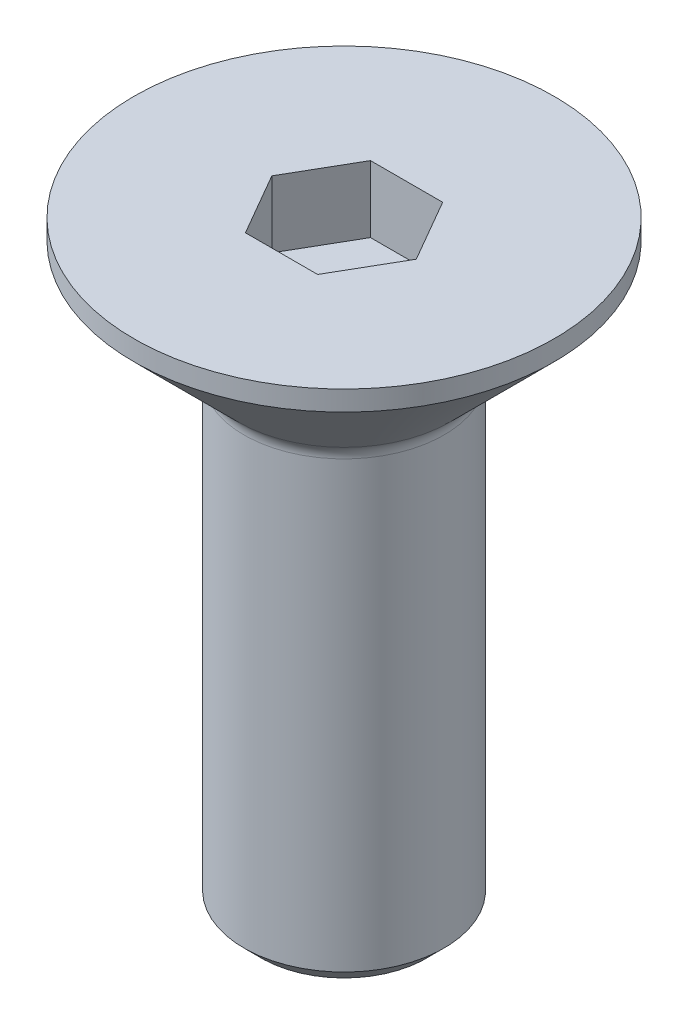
from build123d import *

# Parameters (mm, degrees)
ENL_V_MAT_EXTRU_1_DEPTH = 1.333333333


with BuildPart() as part:
    # Esquisse1 → R_volution1 (revolve)
    with BuildSketch(Plane.XY, mode=Mode.PRIVATE) as r_volution1_sk:
        with BuildLine():
            Line((4.2, -0.4), (2.117157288, -2.482842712))
            ThreePointArc((2.117157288, -2.482842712), (2.030448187, -2.612612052), (2, -2.765685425))
            Line((2, -2.765685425), (2, -11.65))
            Line((2, -11.65), (1.65, -12))
            Line((1.65, -12), (0, -12))
            Line((0, -12), (0, 0))
            Line((0, 0), (4.2, 0))
            Line((4.2, 0), (4.2, -0.4))
        make_face()
    revolve(r_volution1_sk.sketch.rotate(Axis((0, 0, 0), (0, -1, 0)), 180), axis=Axis((0, 0, 0), (0, -1, 0)))

    # Esquisse2 → Enl_v. mat.-Extru.1 (cut)
    with BuildSketch(Plane(origin=(0, 0, 0), x_dir=(1, 0, 0), z_dir=(0, 1, 0))):
        Polygon((1.443375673, 0), (0.721687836, 1.25), (-0.721687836, 1.25), (-1.443375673, 0), (-0.721687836, -1.25), (0.721687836, -1.25), align=None)
    extrude(amount=-ENL_V_MAT_EXTRU_1_DEPTH, mode=Mode.SUBTRACT)


solid = part.part
